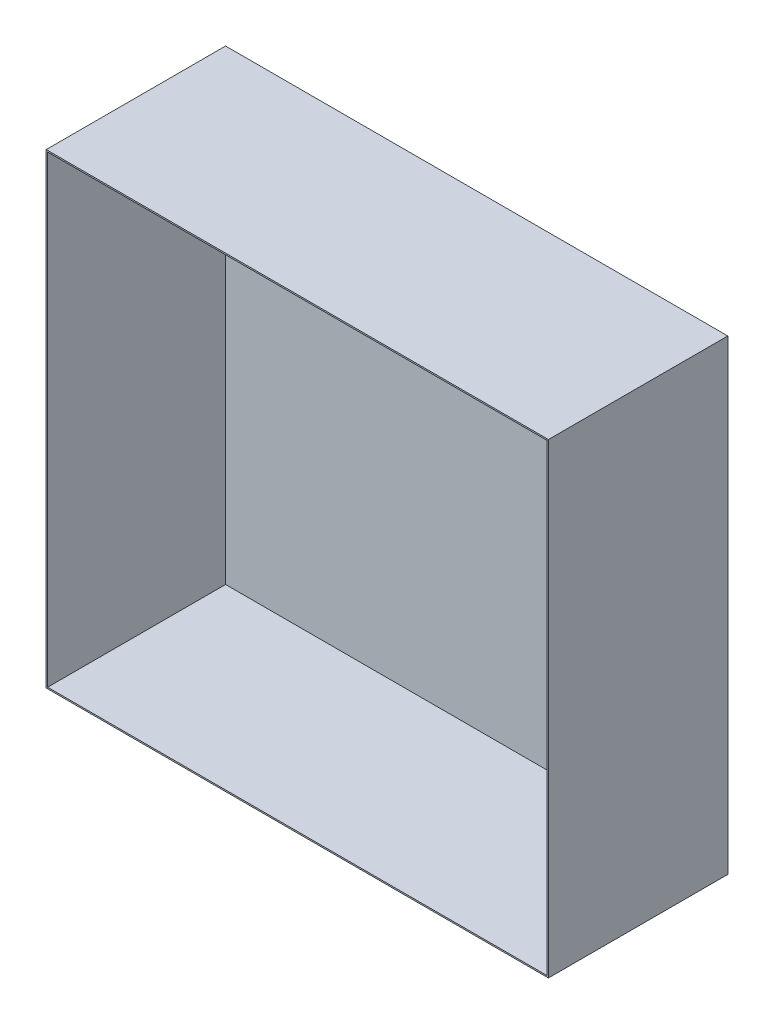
ISO-10303-21;
HEADER;
FILE_DESCRIPTION(('STEP AP214'),'2;1');
FILE_NAME('part.step','',(''),(''),'','','');
FILE_SCHEMA(('AUTOMOTIVE_DESIGN { 1 0 10303 214 1 1 1 1 }'));
ENDSEC;
DATA;
#1=APPLICATION_CONTEXT('core data for automotive mechanical design processes');
#2=APPLICATION_PROTOCOL_DEFINITION('international standard','automotive_design',2000,#1);
#3=PRODUCT_CONTEXT('',#1,'mechanical');
#4=PRODUCT('Part','Part','',(#3));
#5=PRODUCT_RELATED_PRODUCT_CATEGORY('part','',(#4));
#6=PRODUCT_DEFINITION_FORMATION('','',#4);
#7=PRODUCT_DEFINITION_CONTEXT('part definition',#1,'design');
#8=PRODUCT_DEFINITION('design','',#6,#7);
#9=PRODUCT_DEFINITION_SHAPE('','',#8);
#10=(LENGTH_UNIT() NAMED_UNIT(*) SI_UNIT(.MILLI.,.METRE.));
#11=(NAMED_UNIT(*) PLANE_ANGLE_UNIT() SI_UNIT($,.RADIAN.));
#12=(NAMED_UNIT(*) SI_UNIT($,.STERADIAN.) SOLID_ANGLE_UNIT());
#13=UNCERTAINTY_MEASURE_WITH_UNIT(LENGTH_MEASURE(1.E-05),#10,'distance_accuracy_value','');
#14=(GEOMETRIC_REPRESENTATION_CONTEXT(3) GLOBAL_UNCERTAINTY_ASSIGNED_CONTEXT((#13)) GLOBAL_UNIT_ASSIGNED_CONTEXT((#10,
#11,#12)) REPRESENTATION_CONTEXT('',''));
#15=CARTESIAN_POINT('',(0.,0.,0.));
#16=DIRECTION('',(0.,0.,1.));
#17=DIRECTION('',(1.,0.,0.));
#18=AXIS2_PLACEMENT_3D('',#15,#16,#17);
#19=CARTESIAN_POINT('',(-350.,650.,250.));
#20=DIRECTION('',(1.,0.,0.));
#21=DIRECTION('',(0.,1.,0.));
#22=AXIS2_PLACEMENT_3D('',#19,#20,#21);
#23=PLANE('',#22);
#24=DIRECTION('',(0.,-1.,0.));
#25=VECTOR('',#24,1.);
#26=CARTESIAN_POINT('',(-350.,650.,0.));
#27=LINE('',#26,#25);
#28=CARTESIAN_POINT('',(-350.,650.,0.));
#29=VERTEX_POINT('',#28);
#30=CARTESIAN_POINT('',(-350.,0.,0.));
#31=VERTEX_POINT('',#30);
#32=EDGE_CURVE('E148',#29,#31,#27,.T.);
#33=ORIENTED_EDGE('',*,*,#32,.T.);
#34=DIRECTION('',(0.,0.,-1.));
#35=VECTOR('',#34,1.);
#36=CARTESIAN_POINT('',(-350.,0.,250.));
#37=LINE('',#36,#35);
#38=CARTESIAN_POINT('',(-350.,0.,250.));
#39=VERTEX_POINT('',#38);
#40=EDGE_CURVE('E11',#39,#31,#37,.T.);
#41=ORIENTED_EDGE('',*,*,#40,.F.);
#42=DIRECTION('',(0.,-1.,0.));
#43=VECTOR('',#42,1.);
#44=CARTESIAN_POINT('',(-350.,650.,250.));
#45=LINE('',#44,#43);
#46=CARTESIAN_POINT('',(-350.,650.,250.));
#47=VERTEX_POINT('',#46);
#48=EDGE_CURVE('E141',#47,#39,#45,.T.);
#49=ORIENTED_EDGE('',*,*,#48,.F.);
#50=DIRECTION('',(0.,0.,-1.));
#51=VECTOR('',#50,1.);
#52=CARTESIAN_POINT('',(-350.,650.,250.));
#53=LINE('',#52,#51);
#54=EDGE_CURVE('E147',#47,#29,#53,.T.);
#55=ORIENTED_EDGE('',*,*,#54,.T.);
#56=EDGE_LOOP('',(#33,#41,#49,#55));
#57=FACE_BOUND('',#56,.T.);
#58=ADVANCED_FACE('F34',(#57),#23,.F.);
#59=CARTESIAN_POINT('',(-350.,0.,250.));
#60=DIRECTION('',(0.,1.,0.));
#61=DIRECTION('',(0.,0.,1.));
#62=AXIS2_PLACEMENT_3D('',#59,#60,#61);
#63=PLANE('',#62);
#64=DIRECTION('',(1.,0.,0.));
#65=VECTOR('',#64,1.);
#66=CARTESIAN_POINT('',(-350.,0.,0.));
#67=LINE('',#66,#65);
#68=CARTESIAN_POINT('',(350.,0.,0.));
#69=VERTEX_POINT('',#68);
#70=EDGE_CURVE('E151',#31,#69,#67,.T.);
#71=ORIENTED_EDGE('',*,*,#70,.T.);
#72=DIRECTION('',(0.,0.,-1.));
#73=VECTOR('',#72,1.);
#74=CARTESIAN_POINT('',(350.,0.,250.));
#75=LINE('',#74,#73);
#76=CARTESIAN_POINT('',(350.,0.,250.));
#77=VERTEX_POINT('',#76);
#78=EDGE_CURVE('E41',#77,#69,#75,.T.);
#79=ORIENTED_EDGE('',*,*,#78,.F.);
#80=DIRECTION('',(1.,0.,0.));
#81=VECTOR('',#80,1.);
#82=CARTESIAN_POINT('',(-350.,0.,250.));
#83=LINE('',#82,#81);
#84=EDGE_CURVE('E85',#39,#77,#83,.T.);
#85=ORIENTED_EDGE('',*,*,#84,.F.);
#86=ORIENTED_EDGE('',*,*,#40,.T.);
#87=EDGE_LOOP('',(#71,#79,#85,#86));
#88=FACE_BOUND('',#87,.T.);
#89=ADVANCED_FACE('F180',(#88),#63,.F.);
#90=CARTESIAN_POINT('',(350.,0.,250.));
#91=DIRECTION('',(-1.,0.,0.));
#92=DIRECTION('',(0.,-1.,0.));
#93=AXIS2_PLACEMENT_3D('',#90,#91,#92);
#94=PLANE('',#93);
#95=DIRECTION('',(0.,1.,0.));
#96=VECTOR('',#95,1.);
#97=CARTESIAN_POINT('',(350.,0.,0.));
#98=LINE('',#97,#96);
#99=CARTESIAN_POINT('',(350.,650.,0.));
#100=VERTEX_POINT('',#99);
#101=EDGE_CURVE('E153',#69,#100,#98,.T.);
#102=ORIENTED_EDGE('',*,*,#101,.T.);
#103=DIRECTION('',(0.,0.,-1.));
#104=VECTOR('',#103,1.);
#105=CARTESIAN_POINT('',(350.,650.,250.));
#106=LINE('',#105,#104);
#107=CARTESIAN_POINT('',(350.,650.,250.));
#108=VERTEX_POINT('',#107);
#109=EDGE_CURVE('E157',#108,#100,#106,.T.);
#110=ORIENTED_EDGE('',*,*,#109,.F.);
#111=DIRECTION('',(0.,1.,0.));
#112=VECTOR('',#111,1.);
#113=CARTESIAN_POINT('',(350.,0.,250.));
#114=LINE('',#113,#112);
#115=EDGE_CURVE('E144',#77,#108,#114,.T.);
#116=ORIENTED_EDGE('',*,*,#115,.F.);
#117=ORIENTED_EDGE('',*,*,#78,.T.);
#118=EDGE_LOOP('',(#102,#110,#116,#117));
#119=FACE_BOUND('',#118,.T.);
#120=ADVANCED_FACE('F162',(#119),#94,.F.);
#121=CARTESIAN_POINT('',(350.,650.,250.));
#122=DIRECTION('',(0.,-1.,0.));
#123=DIRECTION('',(0.,0.,-1.));
#124=AXIS2_PLACEMENT_3D('',#121,#122,#123);
#125=PLANE('',#124);
#126=DIRECTION('',(-1.,0.,0.));
#127=VECTOR('',#126,1.);
#128=CARTESIAN_POINT('',(350.,650.,0.));
#129=LINE('',#128,#127);
#130=EDGE_CURVE('E78',#100,#29,#129,.T.);
#131=ORIENTED_EDGE('',*,*,#130,.T.);
#132=ORIENTED_EDGE('',*,*,#54,.F.);
#133=DIRECTION('',(-1.,0.,0.));
#134=VECTOR('',#133,1.);
#135=CARTESIAN_POINT('',(350.,650.,250.));
#136=LINE('',#135,#134);
#137=EDGE_CURVE('E57',#108,#47,#136,.T.);
#138=ORIENTED_EDGE('',*,*,#137,.F.);
#139=ORIENTED_EDGE('',*,*,#109,.T.);
#140=EDGE_LOOP('',(#131,#132,#138,#139));
#141=FACE_BOUND('',#140,.T.);
#142=ADVANCED_FACE('F170',(#141),#125,.F.);
#143=CARTESIAN_POINT('',(-350.,0.,250.));
#144=DIRECTION('',(0.,0.,1.));
#145=DIRECTION('',(1.,0.,0.));
#146=AXIS2_PLACEMENT_3D('',#143,#144,#145);
#147=PLANE('',#146);
#148=DIRECTION('',(0.,-1.,0.));
#149=VECTOR('',#148,1.);
#150=CARTESIAN_POINT('',(-348.,650.,250.));
#151=LINE('',#150,#149);
#152=CARTESIAN_POINT('',(-348.,648.,250.));
#153=VERTEX_POINT('',#152);
#154=CARTESIAN_POINT('',(-348.,2.,250.));
#155=VERTEX_POINT('',#154);
#156=EDGE_CURVE('E130',#153,#155,#151,.T.);
#157=ORIENTED_EDGE('',*,*,#156,.F.);
#158=DIRECTION('',(-1.,0.,0.));
#159=VECTOR('',#158,1.);
#160=CARTESIAN_POINT('',(350.,648.,250.));
#161=LINE('',#160,#159);
#162=CARTESIAN_POINT('',(348.,648.,250.));
#163=VERTEX_POINT('',#162);
#164=EDGE_CURVE('E139',#163,#153,#161,.T.);
#165=ORIENTED_EDGE('',*,*,#164,.F.);
#166=DIRECTION('',(0.,1.,0.));
#167=VECTOR('',#166,1.);
#168=CARTESIAN_POINT('',(348.,0.,250.));
#169=LINE('',#168,#167);
#170=CARTESIAN_POINT('',(348.,2.,250.));
#171=VERTEX_POINT('',#170);
#172=EDGE_CURVE('E137',#171,#163,#169,.T.);
#173=ORIENTED_EDGE('',*,*,#172,.F.);
#174=DIRECTION('',(1.,0.,0.));
#175=VECTOR('',#174,1.);
#176=CARTESIAN_POINT('',(-350.,2.,250.));
#177=LINE('',#176,#175);
#178=EDGE_CURVE('E122',#155,#171,#177,.T.);
#179=ORIENTED_EDGE('',*,*,#178,.F.);
#180=EDGE_LOOP('',(#157,#165,#173,#179));
#181=FACE_BOUND('',#180,.T.);
#182=ORIENTED_EDGE('',*,*,#48,.T.);
#183=ORIENTED_EDGE('',*,*,#84,.T.);
#184=ORIENTED_EDGE('',*,*,#115,.T.);
#185=ORIENTED_EDGE('',*,*,#137,.T.);
#186=EDGE_LOOP('',(#182,#183,#184,#185));
#187=FACE_BOUND('',#186,.T.);
#188=ADVANCED_FACE('F172',(#181,#187),#147,.T.);
#189=CARTESIAN_POINT('',(-350.,0.,0.));
#190=DIRECTION('',(0.,0.,1.));
#191=DIRECTION('',(1.,0.,0.));
#192=AXIS2_PLACEMENT_3D('',#189,#190,#191);
#193=PLANE('',#192);
#194=ORIENTED_EDGE('',*,*,#32,.F.);
#195=ORIENTED_EDGE('',*,*,#130,.F.);
#196=ORIENTED_EDGE('',*,*,#101,.F.);
#197=ORIENTED_EDGE('',*,*,#70,.F.);
#198=EDGE_LOOP('',(#194,#195,#196,#197));
#199=FACE_BOUND('',#198,.T.);
#200=ADVANCED_FACE('F166',(#199),#193,.F.);
#201=CARTESIAN_POINT('',(-348.,650.,250.));
#202=DIRECTION('',(1.,0.,0.));
#203=DIRECTION('',(0.,1.,0.));
#204=AXIS2_PLACEMENT_3D('',#201,#202,#203);
#205=PLANE('',#204);
#206=DIRECTION('',(0.,-1.,0.));
#207=VECTOR('',#206,1.);
#208=CARTESIAN_POINT('',(-348.,650.,2.));
#209=LINE('',#208,#207);
#210=CARTESIAN_POINT('',(-348.,648.,2.));
#211=VERTEX_POINT('',#210);
#212=CARTESIAN_POINT('',(-348.,2.,2.));
#213=VERTEX_POINT('',#212);
#214=EDGE_CURVE('E113',#211,#213,#209,.T.);
#215=ORIENTED_EDGE('',*,*,#214,.F.);
#216=DIRECTION('',(0.,0.,-1.));
#217=VECTOR('',#216,1.);
#218=CARTESIAN_POINT('',(-348.,648.,250.));
#219=LINE('',#218,#217);
#220=EDGE_CURVE('E133',#153,#211,#219,.T.);
#221=ORIENTED_EDGE('',*,*,#220,.F.);
#222=ORIENTED_EDGE('',*,*,#156,.T.);
#223=DIRECTION('',(0.,0.,-1.));
#224=VECTOR('',#223,1.);
#225=CARTESIAN_POINT('',(-348.,2.,250.));
#226=LINE('',#225,#224);
#227=EDGE_CURVE('E125',#155,#213,#226,.T.);
#228=ORIENTED_EDGE('',*,*,#227,.T.);
#229=EDGE_LOOP('',(#215,#221,#222,#228));
#230=FACE_BOUND('',#229,.T.);
#231=ADVANCED_FACE('F207',(#230),#205,.T.);
#232=CARTESIAN_POINT('',(-350.,2.,250.));
#233=DIRECTION('',(0.,1.,0.));
#234=DIRECTION('',(0.,0.,1.));
#235=AXIS2_PLACEMENT_3D('',#232,#233,#234);
#236=PLANE('',#235);
#237=DIRECTION('',(1.,0.,0.));
#238=VECTOR('',#237,1.);
#239=CARTESIAN_POINT('',(-350.,2.,2.));
#240=LINE('',#239,#238);
#241=CARTESIAN_POINT('',(348.,2.,2.));
#242=VERTEX_POINT('',#241);
#243=EDGE_CURVE('E107',#213,#242,#240,.T.);
#244=ORIENTED_EDGE('',*,*,#243,.F.);
#245=ORIENTED_EDGE('',*,*,#227,.F.);
#246=ORIENTED_EDGE('',*,*,#178,.T.);
#247=DIRECTION('',(0.,0.,-1.));
#248=VECTOR('',#247,1.);
#249=CARTESIAN_POINT('',(348.,2.,250.));
#250=LINE('',#249,#248);
#251=EDGE_CURVE('E119',#171,#242,#250,.T.);
#252=ORIENTED_EDGE('',*,*,#251,.T.);
#253=EDGE_LOOP('',(#244,#245,#246,#252));
#254=FACE_BOUND('',#253,.T.);
#255=ADVANCED_FACE('F120',(#254),#236,.T.);
#256=CARTESIAN_POINT('',(348.,0.,250.));
#257=DIRECTION('',(-1.,0.,0.));
#258=DIRECTION('',(0.,-1.,0.));
#259=AXIS2_PLACEMENT_3D('',#256,#257,#258);
#260=PLANE('',#259);
#261=DIRECTION('',(0.,1.,0.));
#262=VECTOR('',#261,1.);
#263=CARTESIAN_POINT('',(348.,0.,2.));
#264=LINE('',#263,#262);
#265=CARTESIAN_POINT('',(348.,648.,2.));
#266=VERTEX_POINT('',#265);
#267=EDGE_CURVE('E111',#242,#266,#264,.T.);
#268=ORIENTED_EDGE('',*,*,#267,.F.);
#269=ORIENTED_EDGE('',*,*,#251,.F.);
#270=ORIENTED_EDGE('',*,*,#172,.T.);
#271=DIRECTION('',(0.,0.,-1.));
#272=VECTOR('',#271,1.);
#273=CARTESIAN_POINT('',(348.,648.,250.));
#274=LINE('',#273,#272);
#275=EDGE_CURVE('E48',#163,#266,#274,.T.);
#276=ORIENTED_EDGE('',*,*,#275,.T.);
#277=EDGE_LOOP('',(#268,#269,#270,#276));
#278=FACE_BOUND('',#277,.T.);
#279=ADVANCED_FACE('F127',(#278),#260,.T.);
#280=CARTESIAN_POINT('',(350.,648.,250.));
#281=DIRECTION('',(0.,-1.,0.));
#282=DIRECTION('',(0.,0.,-1.));
#283=AXIS2_PLACEMENT_3D('',#280,#281,#282);
#284=PLANE('',#283);
#285=DIRECTION('',(-1.,0.,0.));
#286=VECTOR('',#285,1.);
#287=CARTESIAN_POINT('',(350.,648.,2.));
#288=LINE('',#287,#286);
#289=EDGE_CURVE('E128',#266,#211,#288,.T.);
#290=ORIENTED_EDGE('',*,*,#289,.F.);
#291=ORIENTED_EDGE('',*,*,#275,.F.);
#292=ORIENTED_EDGE('',*,*,#164,.T.);
#293=ORIENTED_EDGE('',*,*,#220,.T.);
#294=EDGE_LOOP('',(#290,#291,#292,#293));
#295=FACE_BOUND('',#294,.T.);
#296=ADVANCED_FACE('F237',(#295),#284,.T.);
#297=CARTESIAN_POINT('',(-350.,0.,2.));
#298=DIRECTION('',(0.,0.,1.));
#299=DIRECTION('',(1.,0.,0.));
#300=AXIS2_PLACEMENT_3D('',#297,#298,#299);
#301=PLANE('',#300);
#302=ORIENTED_EDGE('',*,*,#214,.T.);
#303=ORIENTED_EDGE('',*,*,#243,.T.);
#304=ORIENTED_EDGE('',*,*,#267,.T.);
#305=ORIENTED_EDGE('',*,*,#289,.T.);
#306=EDGE_LOOP('',(#302,#303,#304,#305));
#307=FACE_BOUND('',#306,.T.);
#308=ADVANCED_FACE('F109',(#307),#301,.T.);
#309=CLOSED_SHELL('',(#58,#89,#120,#142,#188,#200,#231,#255,#279,#296,#308));
#310=MANIFOLD_SOLID_BREP('B2',#309);
#311=ADVANCED_BREP_SHAPE_REPRESENTATION('',(#18,#310),#14);
#312=SHAPE_DEFINITION_REPRESENTATION(#9,#311);
ENDSEC;
END-ISO-10303-21;
